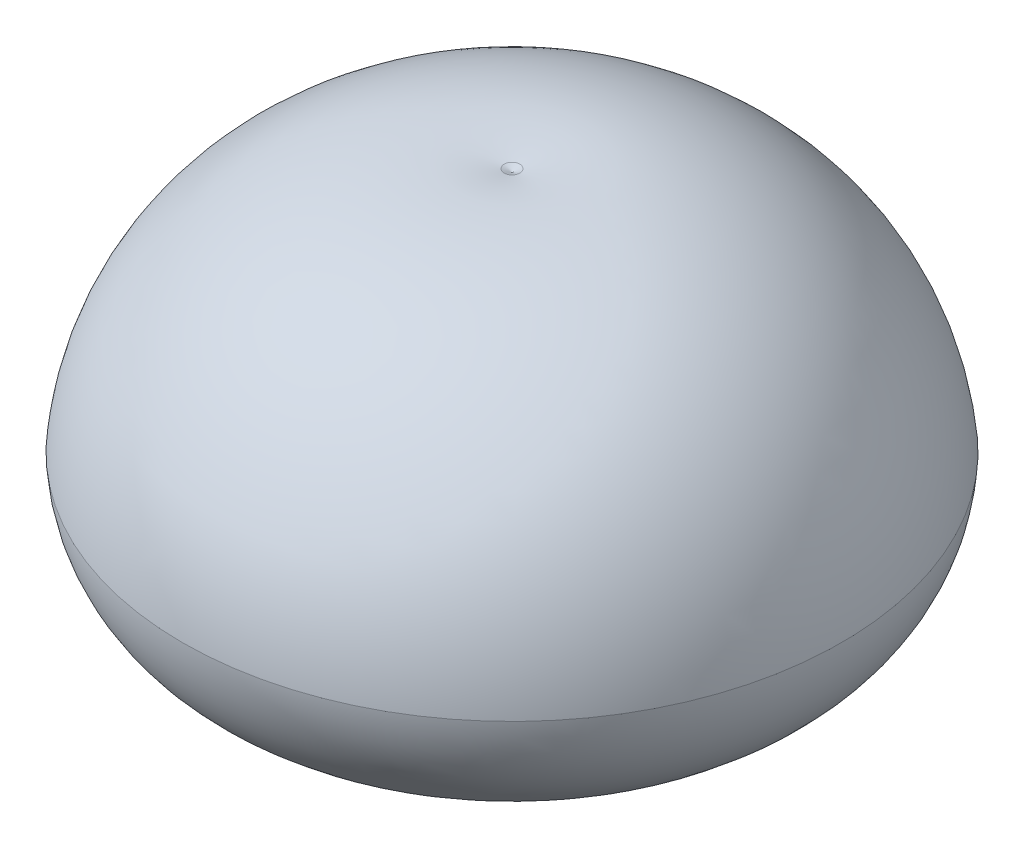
ISO-10303-21;
HEADER;
FILE_DESCRIPTION(('STEP AP214'),'2;1');
FILE_NAME('part.step','',(''),(''),'','','');
FILE_SCHEMA(('AUTOMOTIVE_DESIGN { 1 0 10303 214 1 1 1 1 }'));
ENDSEC;
DATA;
#1=APPLICATION_CONTEXT('core data for automotive mechanical design processes');
#2=APPLICATION_PROTOCOL_DEFINITION('international standard','automotive_design',2000,#1);
#3=PRODUCT_CONTEXT('',#1,'mechanical');
#4=PRODUCT('Part','Part','',(#3));
#5=PRODUCT_RELATED_PRODUCT_CATEGORY('part','',(#4));
#6=PRODUCT_DEFINITION_FORMATION('','',#4);
#7=PRODUCT_DEFINITION_CONTEXT('part definition',#1,'design');
#8=PRODUCT_DEFINITION('design','',#6,#7);
#9=PRODUCT_DEFINITION_SHAPE('','',#8);
#10=(LENGTH_UNIT() NAMED_UNIT(*) SI_UNIT(.MILLI.,.METRE.));
#11=(NAMED_UNIT(*) PLANE_ANGLE_UNIT() SI_UNIT($,.RADIAN.));
#12=(NAMED_UNIT(*) SI_UNIT($,.STERADIAN.) SOLID_ANGLE_UNIT());
#13=UNCERTAINTY_MEASURE_WITH_UNIT(LENGTH_MEASURE(1.E-05),#10,'distance_accuracy_value','');
#14=(GEOMETRIC_REPRESENTATION_CONTEXT(3) GLOBAL_UNCERTAINTY_ASSIGNED_CONTEXT((#13)) GLOBAL_UNIT_ASSIGNED_CONTEXT((#10,
#11,#12)) REPRESENTATION_CONTEXT('',''));
#15=CARTESIAN_POINT('',(0.,0.,0.));
#16=DIRECTION('',(0.,0.,1.));
#17=DIRECTION('',(1.,0.,0.));
#18=AXIS2_PLACEMENT_3D('',#15,#16,#17);
#19=CARTESIAN_POINT('',(0.,2370.10538679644,-423.04411583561));
#20=DIRECTION('',(-1.,0.,0.));
#21=DIRECTION('',(0.,0.,-1.));
#22=AXIS2_PLACEMENT_3D('',#19,#20,#21);
#23=CIRCLE('',#22,1050.);
#24=TRIMMED_CURVE('',#23,(PARAMETER_VALUE(-1.98547860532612)),
(PARAMETER_VALUE(1.98547860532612)),.T.,.PARAMETER.);
#25=CARTESIAN_POINT('',(0.,2370.10538679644,0.));
#26=DIRECTION('',(0.,-1.,0.));
#27=AXIS1_PLACEMENT('',#25,#26);
#28=SURFACE_OF_REVOLUTION('',#24,#27);
#29=CARTESIAN_POINT('',(0.,3356.78263862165,0.));
#30=DIRECTION('',(0.,-1.,0.));
#31=DIRECTION('',(0.,0.,-1.));
#32=AXIS2_PLACEMENT_3D('',#29,#30,#31);
#33=CIRCLE('',#32,63.9229653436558);
#34=CARTESIAN_POINT('',(0.,3356.78263862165,-63.9229653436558));
#35=VERTEX_POINT('',#34);
#36=EDGE_CURVE('E10',#35,#35,#33,.T.);
#37=ORIENTED_EDGE('',*,*,#36,.F.);
#38=EDGE_LOOP('',(#37));
#39=FACE_BOUND('',#38,.T.);
#40=CARTESIAN_POINT('',(0.,3331.11198201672,0.));
#41=VERTEX_POINT('',#40);
#42=VERTEX_LOOP('',#41);
#43=FACE_BOUND('',#42,.T.);
#44=ADVANCED_FACE('F15',(#39,#43),#28,.T.);
#45=CARTESIAN_POINT('',(0.,1140.,0.));
#46=DIRECTION('',(0.,-1.,0.));
#47=DIRECTION('',(0.,0.,-1.));
#48=AXIS2_PLACEMENT_3D('',#45,#46,#47);
#49=DEGENERATE_TOROIDAL_SURFACE('',#48,460.,2251.8886038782,.T.);
#50=CARTESIAN_POINT('',(0.,1341.36450458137,0.));
#51=DIRECTION('',(0.,-1.,0.));
#52=DIRECTION('',(0.,0.,-1.));
#53=AXIS2_PLACEMENT_3D('',#50,#51,#52);
#54=CIRCLE('',#53,2702.86749955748);
#55=CARTESIAN_POINT('',(0.,1341.36450458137,-2702.86749955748));
#56=VERTEX_POINT('',#55);
#57=EDGE_CURVE('E22',#56,#56,#54,.T.);
#58=ORIENTED_EDGE('',*,*,#57,.F.);
#59=EDGE_LOOP('',(#58));
#60=FACE_BOUND('',#59,.T.);
#61=ORIENTED_EDGE('',*,*,#36,.T.);
#62=EDGE_LOOP('',(#61));
#63=FACE_BOUND('',#62,.T.);
#64=ADVANCED_FACE('F48',(#60,#63),#49,.T.);
#65=CARTESIAN_POINT('',(0.,1411.75999735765,0.));
#66=DIRECTION('',(0.,-1.,0.));
#67=DIRECTION('',(0.,0.,-1.));
#68=AXIS2_PLACEMENT_3D('',#65,#66,#67);
#69=TOROIDAL_SURFACE('',#68,1474.22211760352,1230.66039182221);
#70=CARTESIAN_POINT('',(0.,459.142435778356,0.));
#71=DIRECTION('',(0.,-1.,0.));
#72=DIRECTION('',(0.,0.,-1.));
#73=AXIS2_PLACEMENT_3D('',#70,#71,#72);
#74=CIRCLE('',#73,695.091331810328);
#75=CARTESIAN_POINT('',(0.,459.142435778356,-695.091331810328));
#76=VERTEX_POINT('',#75);
#77=EDGE_CURVE('E37',#76,#76,#74,.T.);
#78=ORIENTED_EDGE('',*,*,#77,.F.);
#79=EDGE_LOOP('',(#78));
#80=FACE_BOUND('',#79,.T.);
#81=ORIENTED_EDGE('',*,*,#57,.T.);
#82=EDGE_LOOP('',(#81));
#83=FACE_BOUND('',#82,.T.);
#84=ADVANCED_FACE('F46',(#80,#83),#69,.T.);
#85=CARTESIAN_POINT('',(0.,1140.,0.));
#86=DIRECTION('',(0.,-1.,0.));
#87=DIRECTION('',(0.,0.,-1.));
#88=AXIS2_PLACEMENT_3D('',#85,#86,#87);
#89=DEGENERATE_TOROIDAL_SURFACE('',#88,460.,720.301990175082,.T.);
#90=CARTESIAN_POINT('',(0.,1787.67367560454,0.));
#91=DIRECTION('',(0.,-1.,0.));
#92=DIRECTION('',(0.,0.,-1.));
#93=AXIS2_PLACEMENT_3D('',#90,#91,#92);
#94=CIRCLE('',#93,775.204325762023);
#95=CARTESIAN_POINT('',(0.,1787.67367560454,-775.204325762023));
#96=VERTEX_POINT('',#95);
#97=EDGE_CURVE('E35',#96,#96,#94,.T.);
#98=ORIENTED_EDGE('',*,*,#97,.F.);
#99=EDGE_LOOP('',(#98));
#100=FACE_BOUND('',#99,.T.);
#101=ORIENTED_EDGE('',*,*,#77,.T.);
#102=EDGE_LOOP('',(#101));
#103=FACE_BOUND('',#102,.T.);
#104=ADVANCED_FACE('F31',(#100,#103),#89,.F.);
#105=CARTESIAN_POINT('',(0.,1665.,449.326673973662));
#106=DIRECTION('',(-1.,0.,0.));
#107=DIRECTION('',(0.,0.,-1.));
#108=AXIS2_PLACEMENT_3D('',#105,#106,#107);
#109=CIRCLE('',#108,1230.66039182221);
#110=TRIMMED_CURVE('',#109,(PARAMETER_VALUE(-1.19704514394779)),
(PARAMETER_VALUE(1.19704514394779)),.T.,.PARAMETER.);
#111=CARTESIAN_POINT('',(0.,1665.,0.));
#112=DIRECTION('',(0.,-1.,0.));
#113=AXIS1_PLACEMENT('',#111,#112);
#114=SURFACE_OF_REVOLUTION('',#110,#113);
#115=CARTESIAN_POINT('',(-2.77555756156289E-13,2810.70089467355,0.));
#116=VERTEX_POINT('',#115);
#117=VERTEX_LOOP('',#116);
#118=FACE_BOUND('',#117,.T.);
#119=ORIENTED_EDGE('',*,*,#97,.T.);
#120=EDGE_LOOP('',(#119));
#121=FACE_BOUND('',#120,.T.);
#122=ADVANCED_FACE('F28',(#118,#121),#114,.F.);
#123=CLOSED_SHELL('',(#44,#64,#84,#104,#122));
#124=MANIFOLD_SOLID_BREP('B1',#123);
#125=ADVANCED_BREP_SHAPE_REPRESENTATION('',(#18,#124),#14);
#126=SHAPE_DEFINITION_REPRESENTATION(#9,#125);
ENDSEC;
END-ISO-10303-21;
